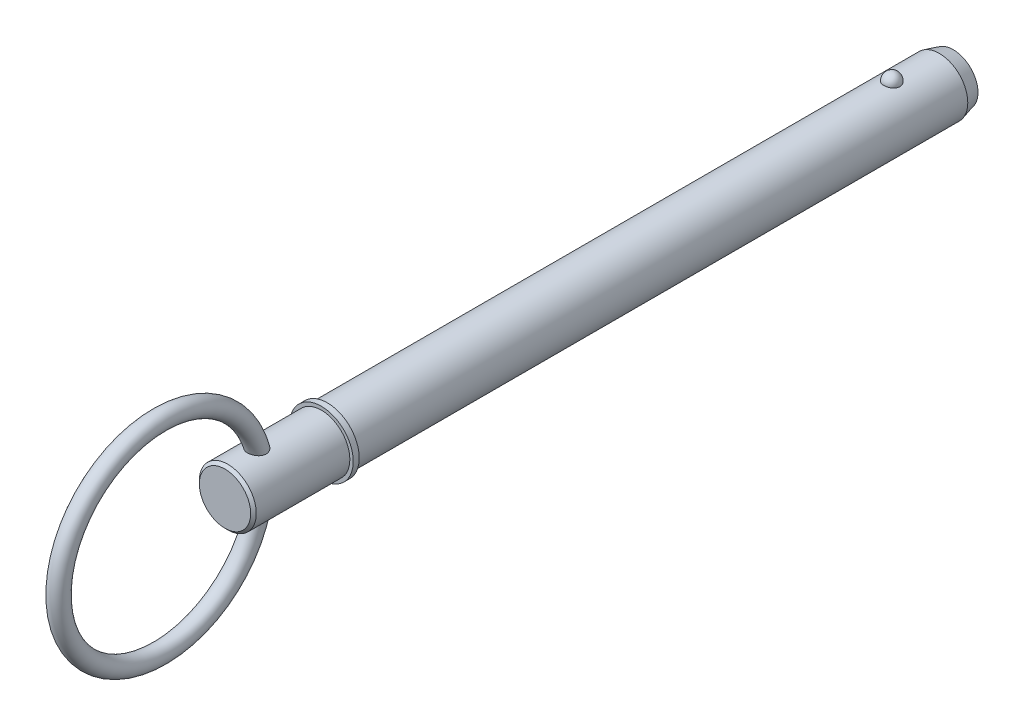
ISO-10303-21;
HEADER;
FILE_DESCRIPTION(('STEP AP214'),'2;1');
FILE_NAME('part.step','',(''),(''),'','','');
FILE_SCHEMA(('AUTOMOTIVE_DESIGN { 1 0 10303 214 1 1 1 1 }'));
ENDSEC;
DATA;
#1=APPLICATION_CONTEXT('core data for automotive mechanical design processes');
#2=APPLICATION_PROTOCOL_DEFINITION('international standard','automotive_design',2000,#1);
#3=PRODUCT_CONTEXT('',#1,'mechanical');
#4=PRODUCT('Part','Part','',(#3));
#5=PRODUCT_RELATED_PRODUCT_CATEGORY('part','',(#4));
#6=PRODUCT_DEFINITION_FORMATION('','',#4);
#7=PRODUCT_DEFINITION_CONTEXT('part definition',#1,'design');
#8=PRODUCT_DEFINITION('design','',#6,#7);
#9=PRODUCT_DEFINITION_SHAPE('','',#8);
#10=(LENGTH_UNIT() NAMED_UNIT(*) SI_UNIT(.MILLI.,.METRE.));
#11=(NAMED_UNIT(*) PLANE_ANGLE_UNIT() SI_UNIT($,.RADIAN.));
#12=(NAMED_UNIT(*) SI_UNIT($,.STERADIAN.) SOLID_ANGLE_UNIT());
#13=UNCERTAINTY_MEASURE_WITH_UNIT(LENGTH_MEASURE(1.E-05),#10,'distance_accuracy_value','');
#14=(GEOMETRIC_REPRESENTATION_CONTEXT(3) GLOBAL_UNCERTAINTY_ASSIGNED_CONTEXT((#13)) GLOBAL_UNIT_ASSIGNED_CONTEXT((#10,
#11,#12)) REPRESENTATION_CONTEXT('',''));
#15=CARTESIAN_POINT('',(0.,0.,0.));
#16=DIRECTION('',(0.,0.,1.));
#17=DIRECTION('',(1.,0.,0.));
#18=AXIS2_PLACEMENT_3D('',#15,#16,#17);
#19=CARTESIAN_POINT('',(0.,0.,139.7));
#20=DIRECTION('',(0.,0.,-1.));
#21=DIRECTION('',(-1.,0.,0.));
#22=AXIS2_PLACEMENT_3D('',#19,#20,#21);
#23=CYLINDRICAL_SURFACE('',#22,7.145);
#24=CARTESIAN_POINT('',(1.99971637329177,6.85945766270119,-2.01999999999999));
#25=CARTESIAN_POINT('',(1.9997145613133,6.85945924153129,-1.90709736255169));
#26=CARTESIAN_POINT('',(1.99051486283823,6.86216053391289,-1.79417185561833));
#27=CARTESIAN_POINT('',(1.95393597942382,6.87266409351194,-1.57152267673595));
#28=CARTESIAN_POINT('',(1.92655029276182,6.88046818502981,-1.46180016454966));
#29=CARTESIAN_POINT('',(1.85429435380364,6.90029063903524,-1.24873107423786));
#30=CARTESIAN_POINT('',(1.80943177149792,6.91230715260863,-1.14538172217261));
#31=CARTESIAN_POINT('',(1.70333474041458,6.93921158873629,-0.947875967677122));
#32=CARTESIAN_POINT('',(1.64210059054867,6.95409945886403,-0.85371939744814));
#33=CARTESIAN_POINT('',(1.5044381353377,6.98517577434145,-0.676721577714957));
#34=CARTESIAN_POINT('',(1.42793505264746,7.00137037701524,-0.593939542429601));
#35=CARTESIAN_POINT('',(1.26189697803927,7.03319066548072,-0.442536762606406));
#36=CARTESIAN_POINT('',(1.17236198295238,7.04881635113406,-0.373916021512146));
#37=CARTESIAN_POINT('',(0.982932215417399,7.0777121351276,-0.252935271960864));
#38=CARTESIAN_POINT('',(0.883068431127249,7.09098897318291,-0.200528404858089));
#39=CARTESIAN_POINT('',(0.675560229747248,7.11375589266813,-0.113212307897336));
#40=CARTESIAN_POINT('',(0.567916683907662,7.12324639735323,-0.0783011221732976));
#41=CARTESIAN_POINT('',(0.350006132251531,7.13724173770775,-0.0274707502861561));
#42=CARTESIAN_POINT('',(0.239822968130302,7.14183447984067,-0.011216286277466));
#43=CARTESIAN_POINT('',(0.0181946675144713,7.14583597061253,0.00296794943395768));
#44=CARTESIAN_POINT('',(-0.0932503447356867,7.14524522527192,0.000899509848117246));
#45=CARTESIAN_POINT('',(-0.312527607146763,7.13899247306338,-0.0213331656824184));
#46=CARTESIAN_POINT('',(-0.420388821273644,7.13340426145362,-0.0412340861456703));
#47=CARTESIAN_POINT('',(-0.631141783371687,7.11785474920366,-0.0982040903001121));
#48=CARTESIAN_POINT('',(-0.734033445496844,7.10789337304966,-0.135273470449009));
#49=CARTESIAN_POINT('',(-0.932634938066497,7.08458058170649,-0.225826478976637));
#50=CARTESIAN_POINT('',(-1.02829911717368,7.07120963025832,-0.279405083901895));
#51=CARTESIAN_POINT('',(-1.20927180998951,7.04252043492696,-0.40145733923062));
#52=CARTESIAN_POINT('',(-1.29457925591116,7.02720199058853,-0.469932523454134));
#53=CARTESIAN_POINT('',(-1.45423311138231,6.995926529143,-0.6214381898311));
#54=CARTESIAN_POINT('',(-1.5283348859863,6.97996288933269,-0.704725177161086));
#55=CARTESIAN_POINT('',(-1.66169281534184,6.94942414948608,-0.882667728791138));
#56=CARTESIAN_POINT('',(-1.72094789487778,6.93484915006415,-0.977324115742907));
#57=CARTESIAN_POINT('',(-1.82375276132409,6.90853186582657,-1.17661373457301));
#58=CARTESIAN_POINT('',(-1.86711024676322,6.8968248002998,-1.28135093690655));
#59=CARTESIAN_POINT('',(-1.9360425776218,6.87779420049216,-1.49689986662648));
#60=CARTESIAN_POINT('',(-1.96161794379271,6.87047053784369,-1.60771141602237));
#61=CARTESIAN_POINT('',(-1.99427437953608,6.86106309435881,-1.83176258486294));
#62=CARTESIAN_POINT('',(-2.00143373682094,6.8589571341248,-1.94498985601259));
#63=CARTESIAN_POINT('',(-1.99730449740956,6.86016064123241,-2.17107603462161));
#64=CARTESIAN_POINT('',(-1.98601641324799,6.86346995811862,-2.28393495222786));
#65=CARTESIAN_POINT('',(-1.94538181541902,6.87509649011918,-2.50548437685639));
#66=CARTESIAN_POINT('',(-1.91612773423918,6.88338806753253,-2.61419321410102));
#67=CARTESIAN_POINT('',(-1.84036449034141,6.90402888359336,-2.82501243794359));
#68=CARTESIAN_POINT('',(-1.79385462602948,6.91637828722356,-2.92712255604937));
#69=CARTESIAN_POINT('',(-1.68442067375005,6.94384180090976,-3.12247704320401));
#70=CARTESIAN_POINT('',(-1.62140729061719,6.95897081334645,-3.21566929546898));
#71=CARTESIAN_POINT('',(-1.4806650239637,6.99026742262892,-3.38999412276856));
#72=CARTESIAN_POINT('',(-1.40293556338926,7.00643506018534,-3.47112622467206));
#73=CARTESIAN_POINT('',(-1.2344320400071,7.03807960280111,-3.61938672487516));
#74=CARTESIAN_POINT('',(-1.1436092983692,7.05355363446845,-3.68646046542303));
#75=CARTESIAN_POINT('',(-0.9515914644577,7.08201263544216,-3.80431973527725));
#76=CARTESIAN_POINT('',(-0.850397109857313,7.09499778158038,-3.85510642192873));
#77=CARTESIAN_POINT('',(-0.641823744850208,7.11687679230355,-3.93839532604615));
#78=CARTESIAN_POINT('',(-0.534539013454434,7.1258202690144,-3.97112042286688));
#79=CARTESIAN_POINT('',(-0.315743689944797,7.1388605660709,-4.01830716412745));
#80=CARTESIAN_POINT('',(-0.204233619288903,7.14295798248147,-4.03277105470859));
#81=CARTESIAN_POINT('',(0.0175518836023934,7.14582273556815,-4.04291389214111));
#82=CARTESIAN_POINT('',(0.127809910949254,7.14469090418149,-4.03894819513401));
#83=CARTESIAN_POINT('',(0.346044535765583,7.13745046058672,-4.01315850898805));
#84=CARTESIAN_POINT('',(0.454021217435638,7.13134203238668,-3.99133518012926));
#85=CARTESIAN_POINT('',(0.664227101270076,7.11483713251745,-3.93057164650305));
#86=CARTESIAN_POINT('',(0.766477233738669,7.10445761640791,-3.89169908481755));
#87=CARTESIAN_POINT('',(0.96292921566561,7.08050813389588,-3.79792023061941));
#88=CARTESIAN_POINT('',(1.05713054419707,7.06693796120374,-3.74301290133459));
#89=CARTESIAN_POINT('',(1.23644031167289,7.03780007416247,-3.61765173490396));
#90=CARTESIAN_POINT('',(1.32138387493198,7.0222044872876,-3.5469686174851));
#91=CARTESIAN_POINT('',(1.47830582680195,6.99085504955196,-3.39245228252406));
#92=CARTESIAN_POINT('',(1.55028198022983,6.97510117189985,-3.30861680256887));
#93=CARTESIAN_POINT('',(1.68063701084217,6.94485803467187,-3.12843058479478));
#94=CARTESIAN_POINT('',(1.73875175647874,6.93039619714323,-3.03188405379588));
#95=CARTESIAN_POINT('',(1.83823393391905,6.90467783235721,-2.83015210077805));
#96=CARTESIAN_POINT('',(1.87960712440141,6.89342020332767,-2.72496966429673));
#97=CARTESIAN_POINT('',(1.94111647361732,6.87633596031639,-2.5205023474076));
#98=CARTESIAN_POINT('',(1.96305249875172,6.87005682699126,-2.4217922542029));
#99=CARTESIAN_POINT('',(1.99235308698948,6.86161702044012,-2.22206084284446));
#100=CARTESIAN_POINT('',(1.99971799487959,6.85945624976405,-2.12103957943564));
#101=CARTESIAN_POINT('',(1.99971637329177,6.85945766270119,-2.01999999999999));
#102=B_SPLINE_CURVE_WITH_KNOTS('',3,(#24,#25,#26,#27,#28,#29,#30,#31,#32,#33,#34,#35,#36,#37,
#38,#39,#40,#41,#42,#43,#44,#45,#46,#47,#48,#49,#50,#51,#52,#53,#54,#55,#56,#57,#58,#59,#60,#61,
#62,#63,#64,#65,#66,#67,#68,#69,#70,#71,#72,#73,#74,#75,#76,#77,#78,#79,#80,#81,#82,#83,#84,#85,
#86,#87,#88,#89,#90,#91,#92,#93,#94,#95,#96,#97,#98,#99,#100,#101),.UNSPECIFIED.,.T.,.F.,(4,2,2,
2,2,2,2,2,2,2,2,2,2,2,2,2,2,2,2,2,2,2,2,2,2,2,2,2,2,2,2,2,2,2,2,2,2,2,4),(0.,0.338345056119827,
0.67681114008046,1.01512885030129,1.35344038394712,1.69345130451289,2.0334623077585,
2.37248128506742,2.71146235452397,3.04425125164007,3.37700766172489,3.70493009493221,
4.03285819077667,4.36270921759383,4.69259422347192,5.02887632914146,5.36518278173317,
5.70543263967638,6.04567253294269,6.38446363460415,6.72324532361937,7.0602984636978,
7.39736530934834,7.73629500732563,8.07523799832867,8.4154752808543,8.7556883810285,
9.09160363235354,9.42747756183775,9.75690239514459,10.0863150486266,10.4144324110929,
10.7425709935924,11.0758313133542,11.4091490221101,11.748385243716,12.0875046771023,
12.3903058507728,12.6930998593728),.UNSPECIFIED.);
#103=CARTESIAN_POINT('',(1.99971637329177,6.85945766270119,-2.01999999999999));
#104=VERTEX_POINT('',#103);
#105=EDGE_CURVE('E100',#104,#104,#102,.T.);
#106=ORIENTED_EDGE('',*,*,#105,.T.);
#107=EDGE_LOOP('',(#106));
#108=FACE_BOUND('',#107,.T.);
#109=CARTESIAN_POINT('',(0.,0.,-13.95));
#110=DIRECTION('',(0.,0.,-1.));
#111=DIRECTION('',(-1.,0.,0.));
#112=AXIS2_PLACEMENT_3D('',#109,#110,#111);
#113=CIRCLE('',#112,7.145);
#114=CARTESIAN_POINT('',(7.145,0.,-13.95));
#115=VERTEX_POINT('',#114);
#116=EDGE_CURVE('E107',#115,#115,#113,.F.);
#117=ORIENTED_EDGE('',*,*,#116,.T.);
#118=EDGE_LOOP('',(#117));
#119=FACE_BOUND('',#118,.T.);
#120=CARTESIAN_POINT('',(0.,0.,139.7));
#121=DIRECTION('',(0.,0.,1.));
#122=DIRECTION('',(1.,0.,0.));
#123=AXIS2_PLACEMENT_3D('',#120,#121,#122);
#124=CIRCLE('',#123,7.145);
#125=CARTESIAN_POINT('',(7.145,0.,139.7));
#126=VERTEX_POINT('',#125);
#127=EDGE_CURVE('E105',#126,#126,#124,.T.);
#128=ORIENTED_EDGE('',*,*,#127,.F.);
#129=EDGE_LOOP('',(#128));
#130=FACE_BOUND('',#129,.T.);
#131=ADVANCED_FACE('F39',(#108,#119,#130),#23,.T.);
#132=CARTESIAN_POINT('',(0.,0.,-17.45));
#133=DIRECTION('',(0.,0.,-1.));
#134=DIRECTION('',(-1.,0.,0.));
#135=AXIS2_PLACEMENT_3D('',#132,#133,#134);
#136=PLANE('',#135);
#137=CARTESIAN_POINT('',(0.,0.,-17.45));
#138=DIRECTION('',(0.,0.,-1.));
#139=DIRECTION('',(-1.,0.,0.));
#140=AXIS2_PLACEMENT_3D('',#137,#138,#139);
#141=CIRCLE('',#140,6.20717782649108);
#142=CARTESIAN_POINT('',(6.20717782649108,0.,-17.45));
#143=VERTEX_POINT('',#142);
#144=EDGE_CURVE('E141',#143,#143,#141,.T.);
#145=ORIENTED_EDGE('',*,*,#144,.T.);
#146=EDGE_LOOP('',(#145));
#147=FACE_BOUND('',#146,.T.);
#148=ADVANCED_FACE('F86',(#147),#136,.T.);
#149=CARTESIAN_POINT('',(0.,0.,-17.45));
#150=DIRECTION('',(0.,0.,1.));
#151=DIRECTION('',(1.,0.,0.));
#152=AXIS2_PLACEMENT_3D('',#149,#150,#151);
#153=CONICAL_SURFACE('',#152,6.20717782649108,0.261799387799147);
#154=CARTESIAN_POINT('',(7.145,0.,-13.95));
#155=CARTESIAN_POINT('',(7.13523101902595,0.,-13.9864583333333));
#156=CARTESIAN_POINT('',(7.1254620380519,0.,-14.0229166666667));
#157=CARTESIAN_POINT('',(7.1059240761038,0.,-14.0958333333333));
#158=CARTESIAN_POINT('',(7.09615509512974,0.,-14.1322916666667));
#159=CARTESIAN_POINT('',(7.07661713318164,0.,-14.2052083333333));
#160=CARTESIAN_POINT('',(7.06684815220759,0.,-14.2416666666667));
#161=CARTESIAN_POINT('',(7.04731019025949,0.,-14.3145833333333));
#162=CARTESIAN_POINT('',(7.03754120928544,0.,-14.3510416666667));
#163=CARTESIAN_POINT('',(7.01800324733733,0.,-14.4239583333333));
#164=CARTESIAN_POINT('',(7.00823426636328,0.,-14.4604166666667));
#165=CARTESIAN_POINT('',(6.98869630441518,0.,-14.5333333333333));
#166=CARTESIAN_POINT('',(6.97892732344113,0.,-14.5697916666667));
#167=CARTESIAN_POINT('',(6.95938936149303,0.,-14.6427083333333));
#168=CARTESIAN_POINT('',(6.94962038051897,0.,-14.6791666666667));
#169=CARTESIAN_POINT('',(6.93008241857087,0.,-14.7520833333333));
#170=CARTESIAN_POINT('',(6.92031343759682,0.,-14.7885416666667));
#171=CARTESIAN_POINT('',(6.90077547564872,0.,-14.8614583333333));
#172=CARTESIAN_POINT('',(6.89100649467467,0.,-14.8979166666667));
#173=CARTESIAN_POINT('',(6.87146853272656,0.,-14.9708333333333));
#174=CARTESIAN_POINT('',(6.86169955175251,0.,-15.0072916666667));
#175=CARTESIAN_POINT('',(6.84216158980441,0.,-15.0802083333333));
#176=CARTESIAN_POINT('',(6.83239260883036,0.,-15.1166666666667));
#177=CARTESIAN_POINT('',(6.81285464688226,0.,-15.1895833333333));
#178=CARTESIAN_POINT('',(6.80308566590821,0.,-15.2260416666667));
#179=CARTESIAN_POINT('',(6.7835477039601,0.,-15.2989583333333));
#180=CARTESIAN_POINT('',(6.77377872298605,0.,-15.3354166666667));
#181=CARTESIAN_POINT('',(6.75424076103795,0.,-15.4083333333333));
#182=CARTESIAN_POINT('',(6.7444717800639,0.,-15.4447916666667));
#183=CARTESIAN_POINT('',(6.7249338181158,0.,-15.5177083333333));
#184=CARTESIAN_POINT('',(6.71516483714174,0.,-15.5541666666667));
#185=CARTESIAN_POINT('',(6.69562687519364,0.,-15.6270833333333));
#186=CARTESIAN_POINT('',(6.68585789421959,0.,-15.6635416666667));
#187=CARTESIAN_POINT('',(6.66631993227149,0.,-15.7364583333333));
#188=CARTESIAN_POINT('',(6.65655095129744,0.,-15.7729166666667));
#189=CARTESIAN_POINT('',(6.63701298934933,0.,-15.8458333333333));
#190=CARTESIAN_POINT('',(6.62724400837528,0.,-15.8822916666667));
#191=CARTESIAN_POINT('',(6.60770604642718,0.,-15.9552083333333));
#192=CARTESIAN_POINT('',(6.59793706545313,0.,-15.9916666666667));
#193=CARTESIAN_POINT('',(6.57839910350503,0.,-16.0645833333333));
#194=CARTESIAN_POINT('',(6.56863012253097,0.,-16.1010416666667));
#195=CARTESIAN_POINT('',(6.54909216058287,0.,-16.1739583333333));
#196=CARTESIAN_POINT('',(6.53932317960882,0.,-16.2104166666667));
#197=CARTESIAN_POINT('',(6.51978521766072,0.,-16.2833333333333));
#198=CARTESIAN_POINT('',(6.51001623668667,0.,-16.3197916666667));
#199=CARTESIAN_POINT('',(6.49047827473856,0.,-16.3927083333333));
#200=CARTESIAN_POINT('',(6.48070929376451,0.,-16.4291666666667));
#201=CARTESIAN_POINT('',(6.46117133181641,0.,-16.5020833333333));
#202=CARTESIAN_POINT('',(6.45140235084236,0.,-16.5385416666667));
#203=CARTESIAN_POINT('',(6.43186438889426,0.,-16.6114583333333));
#204=CARTESIAN_POINT('',(6.42209540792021,0.,-16.6479166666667));
#205=CARTESIAN_POINT('',(6.4025574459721,0.,-16.7208333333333));
#206=CARTESIAN_POINT('',(6.39278846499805,0.,-16.7572916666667));
#207=CARTESIAN_POINT('',(6.37325050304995,0.,-16.8302083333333));
#208=CARTESIAN_POINT('',(6.3634815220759,0.,-16.8666666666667));
#209=CARTESIAN_POINT('',(6.34394356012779,0.,-16.9395833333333));
#210=CARTESIAN_POINT('',(6.33417457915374,0.,-16.9760416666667));
#211=CARTESIAN_POINT('',(6.31463661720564,0.,-17.0489583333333));
#212=CARTESIAN_POINT('',(6.30486763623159,0.,-17.0854166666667));
#213=CARTESIAN_POINT('',(6.28532967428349,0.,-17.1583333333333));
#214=CARTESIAN_POINT('',(6.27556069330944,0.,-17.1947916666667));
#215=CARTESIAN_POINT('',(6.25602273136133,0.,-17.2677083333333));
#216=CARTESIAN_POINT('',(6.24625375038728,0.,-17.3041666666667));
#217=CARTESIAN_POINT('',(6.22671578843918,0.,-17.3770833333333));
#218=CARTESIAN_POINT('',(6.21694680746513,0.,-17.4135416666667));
#219=CARTESIAN_POINT('',(6.20717782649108,0.,-17.45));
#220=B_SPLINE_CURVE_WITH_KNOTS('',3,(#154,#155,#156,#157,#158,#159,#160,#161,#162,#163,#164,
#165,#166,#167,#168,#169,#170,#171,#172,#173,#174,#175,#176,#177,#178,#179,#180,#181,#182,#183,
#184,#185,#186,#187,#188,#189,#190,#191,#192,#193,#194,#195,#196,#197,#198,#199,#200,#201,#202,
#203,#204,#205,#206,#207,#208,#209,#210,#211,#212,#213,#214,#215,#216,#217,#218,#219),
.UNSPECIFIED.,.F.,.F.,(4,2,2,2,2,2,2,2,2,2,2,2,2,2,2,2,2,2,2,2,2,2,2,2,2,2,2,2,2,2,2,2,4),(0.,
0.113233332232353,0.226466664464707,0.33969999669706,0.452933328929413,0.566166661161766,
0.679399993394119,0.792633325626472,0.905866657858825,1.01909999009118,1.13233332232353,
1.24556665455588,1.35879998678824,1.47203331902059,1.58526665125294,1.6984999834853,
1.81173331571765,1.92496664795,2.03819998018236,2.15143331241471,2.26466664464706,
2.37789997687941,2.49113330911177,2.60436664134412,2.71759997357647,2.83083330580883,
2.94406663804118,3.05729997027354,3.17053330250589,3.28376663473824,3.39699996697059,
3.51023329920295,3.6234666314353),.UNSPECIFIED.);
#221=EDGE_CURVE('BSEAM92',#115,#143,#220,.T.);
#222=ORIENTED_EDGE('',*,*,#116,.F.);
#223=ORIENTED_EDGE('',*,*,#144,.F.);
#224=ORIENTED_EDGE('',*,*,#221,.T.);
#225=ORIENTED_EDGE('',*,*,#221,.F.);
#226=EDGE_LOOP('',(#222,#224,#223,#225));
#227=FACE_BOUND('',#226,.T.);
#228=ADVANCED_FACE('F92',(#227),#153,.T.);
#229=CARTESIAN_POINT('',(0.,7.145,-2.01999999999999));
#230=DIRECTION('',(0.,1.,0.));
#231=DIRECTION('',(0.,0.,1.));
#232=AXIS2_PLACEMENT_3D('',#229,#230,#231);
#233=SPHERICAL_SURFACE('',#232,2.02);
#234=ORIENTED_EDGE('',*,*,#105,.F.);
#235=EDGE_LOOP('',(#234));
#236=FACE_BOUND('',#235,.T.);
#237=ADVANCED_FACE('F110',(#236),#233,.T.);
#238=CARTESIAN_POINT('',(0.,0.,139.7));
#239=DIRECTION('',(0.,0.,-1.));
#240=DIRECTION('',(-1.,0.,0.));
#241=AXIS2_PLACEMENT_3D('',#238,#239,#240);
#242=PLANE('',#241);
#243=ORIENTED_EDGE('',*,*,#127,.T.);
#244=EDGE_LOOP('',(#243));
#245=FACE_BOUND('',#244,.T.);
#246=CARTESIAN_POINT('',(0.,0.,139.7));
#247=DIRECTION('',(0.,0.,-1.));
#248=DIRECTION('',(-1.,0.,0.));
#249=AXIS2_PLACEMENT_3D('',#246,#247,#248);
#250=CIRCLE('',#249,8.);
#251=CARTESIAN_POINT('',(-8.,0.,139.7));
#252=VERTEX_POINT('',#251);
#253=EDGE_CURVE('E106',#252,#252,#250,.T.);
#254=ORIENTED_EDGE('',*,*,#253,.T.);
#255=EDGE_LOOP('',(#254));
#256=FACE_BOUND('',#255,.T.);
#257=ADVANCED_FACE('F114',(#245,#256),#242,.T.);
#258=CARTESIAN_POINT('',(0.,0.,33.7287874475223));
#259=DIRECTION('',(0.,0.,-1.));
#260=DIRECTION('',(-1.,0.,0.));
#261=AXIS2_PLACEMENT_3D('',#258,#259,#260);
#262=CYLINDRICAL_SURFACE('',#261,8.);
#263=CARTESIAN_POINT('',(0.,0.,141.2));
#264=DIRECTION('',(0.,0.,-1.));
#265=DIRECTION('',(-1.,0.,0.));
#266=AXIS2_PLACEMENT_3D('',#263,#264,#265);
#267=CIRCLE('',#266,8.);
#268=CARTESIAN_POINT('',(-8.,0.,141.2));
#269=VERTEX_POINT('',#268);
#270=EDGE_CURVE('E131',#269,#269,#267,.T.);
#271=ORIENTED_EDGE('',*,*,#270,.T.);
#272=EDGE_LOOP('',(#271));
#273=FACE_BOUND('',#272,.T.);
#274=ORIENTED_EDGE('',*,*,#253,.F.);
#275=EDGE_LOOP('',(#274));
#276=FACE_BOUND('',#275,.T.);
#277=ADVANCED_FACE('F118',(#273,#276),#262,.T.);
#278=CARTESIAN_POINT('',(0.,8.,141.2));
#279=DIRECTION('',(0.,0.,1.));
#280=DIRECTION('',(1.,0.,0.));
#281=AXIS2_PLACEMENT_3D('',#278,#279,#280);
#282=PLANE('',#281);
#283=CARTESIAN_POINT('',(0.,0.,141.2));
#284=DIRECTION('',(0.,0.,1.));
#285=DIRECTION('',(1.,0.,0.));
#286=AXIS2_PLACEMENT_3D('',#283,#284,#285);
#287=CIRCLE('',#286,7.145);
#288=CARTESIAN_POINT('',(7.145,0.,141.2));
#289=VERTEX_POINT('',#288);
#290=EDGE_CURVE('E109',#289,#289,#287,.T.);
#291=ORIENTED_EDGE('',*,*,#290,.F.);
#292=EDGE_LOOP('',(#291));
#293=FACE_BOUND('',#292,.T.);
#294=ORIENTED_EDGE('',*,*,#270,.F.);
#295=EDGE_LOOP('',(#294));
#296=FACE_BOUND('',#295,.T.);
#297=ADVANCED_FACE('F83',(#293,#296),#282,.T.);
#298=CARTESIAN_POINT('',(0.,0.,165.4));
#299=DIRECTION('',(0.,0.,-1.));
#300=DIRECTION('',(-1.,0.,0.));
#301=AXIS2_PLACEMENT_3D('',#298,#299,#300);
#302=CYLINDRICAL_SURFACE('',#301,7.145);
#303=CARTESIAN_POINT('',(-1.03551034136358,-7.0695645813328,155.330259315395));
#304=CARTESIAN_POINT('',(-0.923225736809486,-7.08601142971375,155.274402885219));
#305=CARTESIAN_POINT('',(-0.806039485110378,-7.10042113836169,155.227835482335));
#306=CARTESIAN_POINT('',(-0.565173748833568,-7.1236385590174,155.154279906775));
#307=CARTESIAN_POINT('',(-0.441495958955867,-7.13244772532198,155.127286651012));
#308=CARTESIAN_POINT('',(-0.191106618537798,-7.14354309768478,155.093450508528));
#309=CARTESIAN_POINT('',(-0.0643945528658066,-7.14582818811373,155.086611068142));
#310=CARTESIAN_POINT('',(0.18844338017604,-7.14363337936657,155.093241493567));
#311=CARTESIAN_POINT('',(0.314569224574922,-7.13915321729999,155.106712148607));
#312=CARTESIAN_POINT('',(0.562499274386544,-7.12390574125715,155.15364165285));
#313=CARTESIAN_POINT('',(0.684308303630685,-7.11314569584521,155.187077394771));
#314=CARTESIAN_POINT('',(0.920329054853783,-7.08647538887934,155.273194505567));
#315=CARTESIAN_POINT('',(1.0345403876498,-7.07056486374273,155.325876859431));
#316=CARTESIAN_POINT('',(1.2523263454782,-7.03526161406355,155.4494470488));
#317=CARTESIAN_POINT('',(1.35588248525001,-7.01586299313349,155.52036580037));
#318=CARTESIAN_POINT('',(1.54916093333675,-6.9757352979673,155.678757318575));
#319=CARTESIAN_POINT('',(1.63888414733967,-6.95500631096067,155.766229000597));
#320=CARTESIAN_POINT('',(1.80113983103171,-6.91475703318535,155.954727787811));
#321=CARTESIAN_POINT('',(1.87381924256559,-6.89522757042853,156.055626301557));
#322=CARTESIAN_POINT('',(2.00091178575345,-6.8594283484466,156.26884010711));
#323=CARTESIAN_POINT('',(2.05532963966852,-6.8431577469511,156.381152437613));
#324=CARTESIAN_POINT('',(2.14350100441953,-6.81604873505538,156.61119481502));
#325=CARTESIAN_POINT('',(2.17770329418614,-6.80509340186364,156.728739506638));
#326=CARTESIAN_POINT('',(2.22691394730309,-6.7891497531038,156.968149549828));
#327=CARTESIAN_POINT('',(2.2419216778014,-6.7841616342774,157.090015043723));
#328=CARTESIAN_POINT('',(2.25313992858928,-6.78044381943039,157.33580699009));
#329=CARTESIAN_POINT('',(2.24917302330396,-6.78177319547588,157.459742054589));
#330=CARTESIAN_POINT('',(2.22301329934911,-6.79039131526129,157.705438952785));
#331=CARTESIAN_POINT('',(2.20081491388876,-6.79768187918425,157.8272001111));
#332=CARTESIAN_POINT('',(2.13702421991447,-6.81801706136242,158.075287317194));
#333=CARTESIAN_POINT('',(2.09404815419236,-6.83146790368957,158.201223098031));
#334=CARTESIAN_POINT('',(1.98986384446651,-6.86253672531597,158.444824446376));
#335=CARTESIAN_POINT('',(1.92864130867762,-6.88015796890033,158.562483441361));
#336=CARTESIAN_POINT('',(1.7827436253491,-6.91947130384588,158.797497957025));
#337=CARTESIAN_POINT('',(1.6964070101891,-6.94139021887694,158.913789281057));
#338=CARTESIAN_POINT('',(1.50503944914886,-6.98537683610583,159.129799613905));
#339=CARTESIAN_POINT('',(1.40001969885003,-7.00744444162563,159.229528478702));
#340=CARTESIAN_POINT('',(1.19221781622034,-7.04548349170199,159.393170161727));
#341=CARTESIAN_POINT('',(1.09203347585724,-7.06185586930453,159.46028599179));
#342=CARTESIAN_POINT('',(0.88160718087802,-7.09119477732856,159.577337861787));
#343=CARTESIAN_POINT('',(0.771372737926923,-7.10416382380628,159.627286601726));
#344=CARTESIAN_POINT('',(0.542622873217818,-7.12529560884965,159.707475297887));
#345=CARTESIAN_POINT('',(0.424058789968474,-7.13342692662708,159.73758654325));
#346=CARTESIAN_POINT('',(0.183155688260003,-7.14366628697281,159.775370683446));
#347=CARTESIAN_POINT('',(0.0608191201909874,-7.14577815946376,159.783057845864));
#348=CARTESIAN_POINT('',(-0.169367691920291,-7.14381572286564,159.775860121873));
#349=CARTESIAN_POINT('',(-0.277308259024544,-7.14040669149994,159.763402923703));
#350=CARTESIAN_POINT('',(-0.489468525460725,-7.12900651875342,159.721156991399));
#351=CARTESIAN_POINT('',(-0.593687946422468,-7.12101503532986,159.691366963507));
#352=CARTESIAN_POINT('',(-0.796149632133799,-7.10123695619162,159.615987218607));
#353=CARTESIAN_POINT('',(-0.894373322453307,-7.08943921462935,159.570351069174));
#354=CARTESIAN_POINT('',(-1.08274371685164,-7.06312621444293,159.465336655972));
#355=CARTESIAN_POINT('',(-1.17288754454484,-7.04860999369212,159.405953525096));
#356=CARTESIAN_POINT('',(-1.35484961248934,-7.01605385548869,159.267113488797));
#357=CARTESIAN_POINT('',(-1.44541008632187,-6.99780069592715,159.186061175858));
#358=CARTESIAN_POINT('',(-1.61364655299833,-6.96093393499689,159.011599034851));
#359=CARTESIAN_POINT('',(-1.69131381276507,-6.94232009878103,158.918180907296));
#360=CARTESIAN_POINT('',(-1.843300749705,-6.90364386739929,158.706608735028));
#361=CARTESIAN_POINT('',(-1.91543090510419,-6.88377370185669,158.586839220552));
#362=CARTESIAN_POINT('',(-2.04002946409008,-6.84788436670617,158.336875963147));
#363=CARTESIAN_POINT('',(-2.09248830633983,-6.83186707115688,158.206677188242));
#364=CARTESIAN_POINT('',(-2.17795964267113,-6.80511869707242,157.932555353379));
#365=CARTESIAN_POINT('',(-2.20992909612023,-6.79467512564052,157.788274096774));
#366=CARTESIAN_POINT('',(-2.24813111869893,-6.78213595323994,157.495984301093));
#367=CARTESIAN_POINT('',(-2.25438316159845,-6.78003403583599,157.347978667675));
#368=CARTESIAN_POINT('',(-2.24011368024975,-6.78475868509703,157.065430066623));
#369=CARTESIAN_POINT('',(-2.22172362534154,-6.79087455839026,156.930769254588));
#370=CARTESIAN_POINT('',(-2.16145328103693,-6.81029672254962,156.667367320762));
#371=CARTESIAN_POINT('',(-2.11958615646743,-6.82359898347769,156.538622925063));
#372=CARTESIAN_POINT('',(-2.01784121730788,-6.85433303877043,156.302267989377));
#373=CARTESIAN_POINT('',(-1.9598239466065,-6.8713108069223,156.193792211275));
#374=CARTESIAN_POINT('',(-1.82642155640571,-6.90796511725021,155.988591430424));
#375=CARTESIAN_POINT('',(-1.75103235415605,-6.92764229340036,155.891869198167));
#376=CARTESIAN_POINT('',(-1.57825515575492,-6.96911949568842,155.705408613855));
#377=CARTESIAN_POINT('',(-1.47957996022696,-6.9909623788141,155.61687037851));
#378=CARTESIAN_POINT('',(-1.26760341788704,-7.0324852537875,155.458840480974));
#379=CARTESIAN_POINT('',(-1.15429989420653,-7.05216492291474,155.389351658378));
#380=CARTESIAN_POINT('',(-1.03551034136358,-7.0695645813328,155.330259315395));
#381=B_SPLINE_CURVE_WITH_KNOTS('',3,(#303,#304,#305,#306,#307,#308,#309,#310,#311,#312,#313,
#314,#315,#316,#317,#318,#319,#320,#321,#322,#323,#324,#325,#326,#327,#328,#329,#330,#331,#332,
#333,#334,#335,#336,#337,#338,#339,#340,#341,#342,#343,#344,#345,#346,#347,#348,#349,#350,#351,
#352,#353,#354,#355,#356,#357,#358,#359,#360,#361,#362,#363,#364,#365,#366,#367,#368,#369,#370,
#371,#372,#373,#374,#375,#376,#377,#378,#379,#380),.UNSPECIFIED.,.T.,.F.,(4,2,2,2,2,2,2,2,2,2,2,
2,2,2,2,2,2,2,2,2,2,2,2,2,2,2,2,2,2,2,2,2,2,2,2,2,2,2,4),(0.,0.378979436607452,
0.757860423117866,1.13680619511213,1.51576669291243,1.89428943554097,2.27283155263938,
2.65201969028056,3.03118299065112,3.40694616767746,3.78261210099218,4.14959041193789,
4.51658082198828,4.88700951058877,5.25755134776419,5.6571370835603,6.05703662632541,
6.49445595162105,6.93161403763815,7.29520224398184,7.65852089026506,8.02417421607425,
8.38959483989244,8.71415763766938,9.03874466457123,9.36429093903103,9.68995264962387,
10.0572255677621,10.4247462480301,10.8465602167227,11.2685789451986,11.7106604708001,
12.152407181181,12.5583067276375,12.9639788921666,13.3347314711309,13.7055712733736,
14.1064462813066,14.5073810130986),.UNSPECIFIED.);
#382=CARTESIAN_POINT('',(-1.03551034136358,-7.0695645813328,155.330259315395));
#383=VERTEX_POINT('',#382);
#384=EDGE_CURVE('E10',#383,#383,#381,.T.);
#385=ORIENTED_EDGE('',*,*,#384,.F.);
#386=EDGE_LOOP('',(#385));
#387=FACE_BOUND('',#386,.T.);
#388=CARTESIAN_POINT('',(-1.03551034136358,7.0695645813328,155.330259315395));
#389=CARTESIAN_POINT('',(-1.14644953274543,7.05331457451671,155.385446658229));
#390=CARTESIAN_POINT('',(-1.25260902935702,7.03507806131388,155.449702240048));
#391=CARTESIAN_POINT('',(-1.45240021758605,6.99656564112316,155.594958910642));
#392=CARTESIAN_POINT('',(-1.54602879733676,6.97628922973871,155.675964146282));
#393=CARTESIAN_POINT('',(-1.71815091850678,6.93590796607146,155.852910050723));
#394=CARTESIAN_POINT('',(-1.79663177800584,6.91580327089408,155.948863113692));
#395=CARTESIAN_POINT('',(-1.93607718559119,6.87807159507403,156.153162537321));
#396=CARTESIAN_POINT('',(-1.99704642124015,6.86044395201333,156.261505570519));
#397=CARTESIAN_POINT('',(-2.09894945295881,6.82995115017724,156.485542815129));
#398=CARTESIAN_POINT('',(-2.1402125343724,6.81700866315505,156.601076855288));
#399=CARTESIAN_POINT('',(-2.20347311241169,6.79682602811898,156.837758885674));
#400=CARTESIAN_POINT('',(-2.22547114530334,6.78958572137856,156.958906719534));
#401=CARTESIAN_POINT('',(-2.25026114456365,6.78140983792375,157.203214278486));
#402=CARTESIAN_POINT('',(-2.25306986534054,6.78046876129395,157.32637215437));
#403=CARTESIAN_POINT('',(-2.2403056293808,6.78469532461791,157.571604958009));
#404=CARTESIAN_POINT('',(-2.22472720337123,6.78986478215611,157.693679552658));
#405=CARTESIAN_POINT('',(-2.17472134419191,6.8060520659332,157.942036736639));
#406=CARTESIAN_POINT('',(-2.13910164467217,6.81743831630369,158.068053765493));
#407=CARTESIAN_POINT('',(-2.04975058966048,6.84483151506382,158.312973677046));
#408=CARTESIAN_POINT('',(-1.99600968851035,6.86084089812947,158.431872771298));
#409=CARTESIAN_POINT('',(-1.86558545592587,6.8975101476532,158.671425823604));
#410=CARTESIAN_POINT('',(-1.78715729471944,6.91847353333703,158.791087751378));
#411=CARTESIAN_POINT('',(-1.61149373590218,6.96148580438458,159.015646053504));
#412=CARTESIAN_POINT('',(-1.51424701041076,6.98353533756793,159.12053346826));
#413=CARTESIAN_POINT('',(-1.30107590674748,7.02639179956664,159.312951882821));
#414=CARTESIAN_POINT('',(-1.18492282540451,7.04717858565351,159.400236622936));
#415=CARTESIAN_POINT('',(-0.937392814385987,7.08434208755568,159.550827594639));
#416=CARTESIAN_POINT('',(-0.806039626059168,7.10072555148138,159.614170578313));
#417=CARTESIAN_POINT('',(-0.550470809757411,7.12475629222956,159.705483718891));
#418=CARTESIAN_POINT('',(-0.427643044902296,7.13327781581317,159.737047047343));
#419=CARTESIAN_POINT('',(-0.240556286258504,7.14122488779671,159.766356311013));
#420=CARTESIAN_POINT('',(-0.177714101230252,7.14306799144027,159.773119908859));
#421=CARTESIAN_POINT('',(-0.0516470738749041,7.14509121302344,159.780539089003));
#422=CARTESIAN_POINT('',(0.0115777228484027,7.14527152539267,159.781195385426));
#423=CARTESIAN_POINT('',(0.182932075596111,7.14347436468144,159.774616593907));
#424=CARTESIAN_POINT('',(0.290871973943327,7.13986325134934,159.761408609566));
#425=CARTESIAN_POINT('',(0.502842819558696,7.1280769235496,159.717690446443));
#426=CARTESIAN_POINT('',(0.606873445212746,7.11990133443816,159.687178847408));
#427=CARTESIAN_POINT('',(0.809001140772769,7.09978218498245,159.610378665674));
#428=CARTESIAN_POINT('',(0.907071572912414,7.08782300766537,159.564024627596));
#429=CARTESIAN_POINT('',(1.09503957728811,7.0612282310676,159.457620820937));
#430=CARTESIAN_POINT('',(1.18493426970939,7.04659169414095,159.397566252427));
#431=CARTESIAN_POINT('',(1.36644041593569,7.01380352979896,159.257233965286));
#432=CARTESIAN_POINT('',(1.45676563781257,6.99544216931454,159.175344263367));
#433=CARTESIAN_POINT('',(1.62440639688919,6.95842750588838,158.999231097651));
#434=CARTESIAN_POINT('',(1.701712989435,6.93977401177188,158.904999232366));
#435=CARTESIAN_POINT('',(1.85271606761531,6.90111647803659,158.691807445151));
#436=CARTESIAN_POINT('',(1.92421731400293,6.88131605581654,158.571248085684));
#437=CARTESIAN_POINT('',(2.04739198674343,6.84567995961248,158.319785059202));
#438=CARTESIAN_POINT('',(2.09905621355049,6.82984612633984,158.188876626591));
#439=CARTESIAN_POINT('',(2.18257767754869,6.80363167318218,157.913847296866));
#440=CARTESIAN_POINT('',(2.21345394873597,6.79352430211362,157.769397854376));
#441=CARTESIAN_POINT('',(2.24941288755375,6.78170753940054,157.476984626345));
#442=CARTESIAN_POINT('',(2.2545156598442,6.77999160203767,157.329023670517));
#443=CARTESIAN_POINT('',(2.2380435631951,6.78544298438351,157.047053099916));
#444=CARTESIAN_POINT('',(2.21864521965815,6.79188566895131,156.912903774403));
#445=CARTESIAN_POINT('',(2.1564876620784,6.81187529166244,156.650690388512));
#446=CARTESIAN_POINT('',(2.11373989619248,6.82541874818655,156.52262337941));
#447=CARTESIAN_POINT('',(2.01040099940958,6.85652522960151,156.287507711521));
#448=CARTESIAN_POINT('',(1.95162600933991,6.87365110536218,156.179597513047));
#449=CARTESIAN_POINT('',(1.81683142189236,6.91050025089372,155.975649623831));
#450=CARTESIAN_POINT('',(1.74081238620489,6.93022343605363,155.879611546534));
#451=CARTESIAN_POINT('',(1.57431234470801,6.96992220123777,155.70254183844));
#452=CARTESIAN_POINT('',(1.48394688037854,6.98989467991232,155.621400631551));
#453=CARTESIAN_POINT('',(1.29081365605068,7.02812243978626,155.475038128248));
#454=CARTESIAN_POINT('',(1.18804491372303,7.04637758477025,155.409818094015));
#455=CARTESIAN_POINT('',(0.970386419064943,7.07967210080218,155.295377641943));
#456=CARTESIAN_POINT('',(0.855272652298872,7.09462807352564,155.246558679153));
#457=CARTESIAN_POINT('',(0.618143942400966,7.11920826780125,155.168071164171));
#458=CARTESIAN_POINT('',(0.49612834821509,7.12883198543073,155.138404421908));
#459=CARTESIAN_POINT('',(0.247581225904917,7.14180209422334,155.098698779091));
#460=CARTESIAN_POINT('',(0.121020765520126,7.14509609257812,155.088823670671));
#461=CARTESIAN_POINT('',(-0.132022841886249,7.14489967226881,155.089415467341));
#462=CARTESIAN_POINT('',(-0.258506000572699,7.14141109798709,155.099876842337));
#463=CARTESIAN_POINT('',(-0.496649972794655,7.12862600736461,155.139053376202));
#464=CARTESIAN_POINT('',(-0.608625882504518,7.11987587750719,155.166055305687));
#465=CARTESIAN_POINT('',(-0.826925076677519,7.09783467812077,155.236222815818));
#466=CARTESIAN_POINT('',(-0.933248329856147,7.08454358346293,155.279388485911));
#467=CARTESIAN_POINT('',(-1.03551034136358,7.0695645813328,155.330259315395));
#468=B_SPLINE_CURVE_WITH_KNOTS('',3,(#388,#389,#390,#391,#392,#393,#394,#395,#396,#397,#398,
#399,#400,#401,#402,#403,#404,#405,#406,#407,#408,#409,#410,#411,#412,#413,#414,#415,#416,#417,
#418,#419,#420,#421,#422,#423,#424,#425,#426,#427,#428,#429,#430,#431,#432,#433,#434,#435,#436,
#437,#438,#439,#440,#441,#442,#443,#444,#445,#446,#447,#448,#449,#450,#451,#452,#453,#454,#455,
#456,#457,#458,#459,#460,#461,#462,#463,#464,#465,#466,#467),.UNSPECIFIED.,.T.,.F.,(4,2,2,2,2,2,
2,2,2,2,2,2,2,2,2,2,2,2,2,2,2,2,2,2,2,2,2,2,2,2,2,2,2,2,2,2,2,2,2,4),(0.,0.374504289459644,
0.7491014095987,1.12401080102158,1.49881974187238,1.86712525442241,2.23542051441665,
2.60339417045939,2.97147730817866,3.36420696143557,3.75714381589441,4.18898920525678,
4.62109535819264,5.0588812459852,5.49599234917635,5.87475353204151,6.06416800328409,
6.25356032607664,6.57826179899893,6.90298992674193,7.22907626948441,7.55527703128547,
7.92373585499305,8.29244681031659,8.71527472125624,9.13829848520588,9.58009907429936,
10.0215549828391,10.4264139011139,10.831074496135,11.2014904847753,11.571894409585,
11.9394538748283,12.3070424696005,12.6830655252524,13.0591241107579,13.4382822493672,
13.8173372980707,14.1625475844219,14.5077597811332),.UNSPECIFIED.);
#469=CARTESIAN_POINT('',(-1.03551034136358,7.0695645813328,155.330259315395));
#470=VERTEX_POINT('',#469);
#471=EDGE_CURVE('E51',#470,#470,#468,.T.);
#472=ORIENTED_EDGE('',*,*,#471,.F.);
#473=EDGE_LOOP('',(#472));
#474=FACE_BOUND('',#473,.T.);
#475=CARTESIAN_POINT('',(0.,0.,164.7));
#476=DIRECTION('',(0.,0.,-1.));
#477=DIRECTION('',(-1.,0.,0.));
#478=AXIS2_PLACEMENT_3D('',#475,#476,#477);
#479=CIRCLE('',#478,7.145);
#480=CARTESIAN_POINT('',(-7.145,0.,164.7));
#481=VERTEX_POINT('',#480);
#482=EDGE_CURVE('E62',#481,#481,#479,.T.);
#483=ORIENTED_EDGE('',*,*,#482,.T.);
#484=EDGE_LOOP('',(#483));
#485=FACE_BOUND('',#484,.T.);
#486=ORIENTED_EDGE('',*,*,#290,.T.);
#487=EDGE_LOOP('',(#486));
#488=FACE_BOUND('',#487,.T.);
#489=ADVANCED_FACE('F67',(#387,#474,#485,#488),#302,.T.);
#490=CARTESIAN_POINT('',(0.,0.,165.4));
#491=DIRECTION('',(0.,0.,-1.));
#492=DIRECTION('',(-1.,0.,0.));
#493=AXIS2_PLACEMENT_3D('',#490,#491,#492);
#494=PLANE('',#493);
#495=CARTESIAN_POINT('',(0.,0.,165.4));
#496=DIRECTION('',(0.,0.,-1.));
#497=DIRECTION('',(-1.,0.,0.));
#498=AXIS2_PLACEMENT_3D('',#495,#496,#497);
#499=CIRCLE('',#498,6.44499999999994);
#500=CARTESIAN_POINT('',(-6.44499999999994,0.,165.4));
#501=VERTEX_POINT('',#500);
#502=EDGE_CURVE('E57',#501,#501,#499,.F.);
#503=ORIENTED_EDGE('',*,*,#502,.T.);
#504=EDGE_LOOP('',(#503));
#505=FACE_BOUND('',#504,.T.);
#506=ADVANCED_FACE('F74',(#505),#494,.F.);
#507=CARTESIAN_POINT('',(0.,0.,164.7));
#508=DIRECTION('',(0.,0.,-1.));
#509=DIRECTION('',(-1.,0.,0.));
#510=AXIS2_PLACEMENT_3D('',#507,#508,#509);
#511=CONICAL_SURFACE('',#510,7.145,0.78539816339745);
#512=ORIENTED_EDGE('',*,*,#502,.F.);
#513=EDGE_LOOP('',(#512));
#514=FACE_BOUND('',#513,.T.);
#515=ORIENTED_EDGE('',*,*,#482,.F.);
#516=EDGE_LOOP('',(#515));
#517=FACE_BOUND('',#516,.T.);
#518=ADVANCED_FACE('F41',(#514,#517),#511,.T.);
#519=CARTESIAN_POINT('',(0.,0.,181.8));
#520=DIRECTION('',(1.,0.,0.));
#521=DIRECTION('',(0.,0.,-1.));
#522=AXIS2_PLACEMENT_3D('',#519,#520,#521);
#523=TOROIDAL_SURFACE('',#522,25.4,2.25);
#524=ORIENTED_EDGE('',*,*,#384,.T.);
#525=EDGE_LOOP('',(#524));
#526=FACE_BOUND('',#525,.T.);
#527=ORIENTED_EDGE('',*,*,#471,.T.);
#528=EDGE_LOOP('',(#527));
#529=FACE_BOUND('',#528,.T.);
#530=ADVANCED_FACE('F71',(#526,#529),#523,.T.);
#531=CLOSED_SHELL('',(#131,#148,#228,#237,#257,#277,#297,#489,#506,#518,#530));
#532=MANIFOLD_SOLID_BREP('B2',#531);
#533=ADVANCED_BREP_SHAPE_REPRESENTATION('',(#18,#532),#14);
#534=SHAPE_DEFINITION_REPRESENTATION(#9,#533);
ENDSEC;
END-ISO-10303-21;
